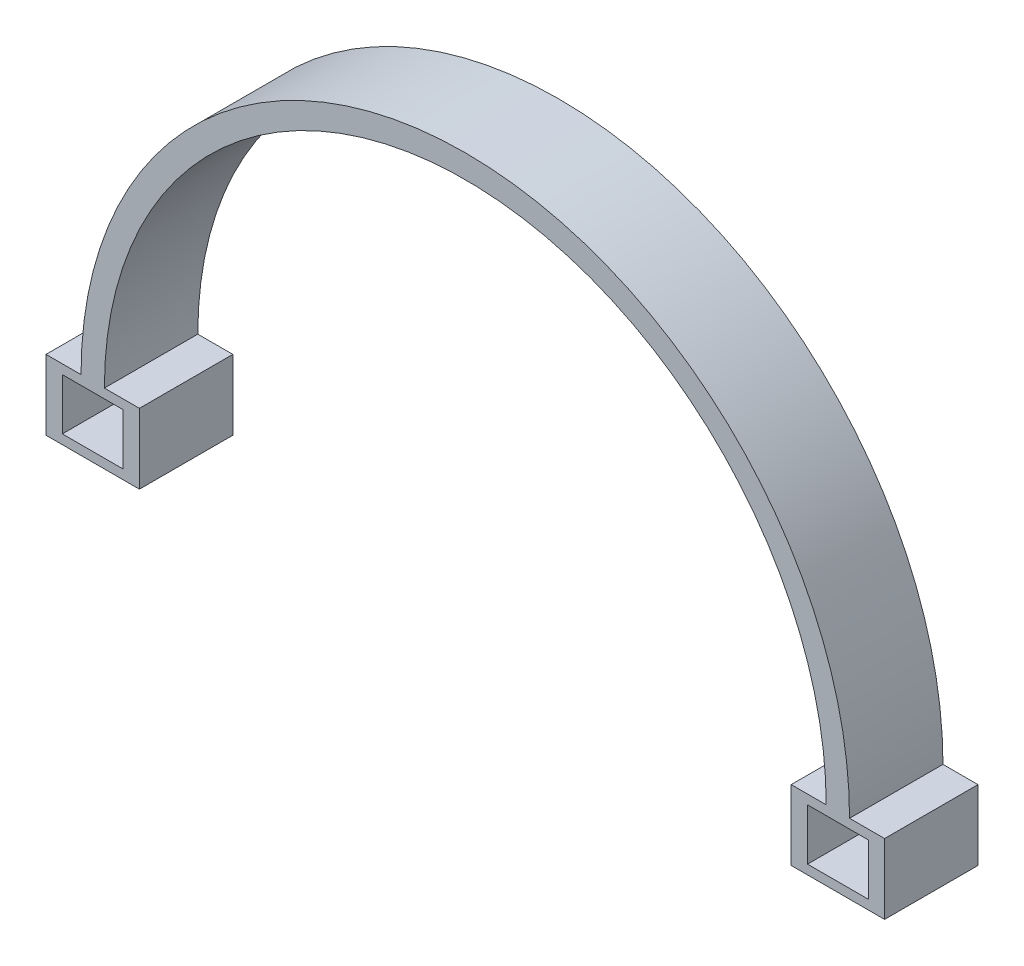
ISO-10303-21;
HEADER;
FILE_DESCRIPTION(('STEP AP214'),'2;1');
FILE_NAME('part.step','',(''),(''),'','','');
FILE_SCHEMA(('AUTOMOTIVE_DESIGN { 1 0 10303 214 1 1 1 1 }'));
ENDSEC;
DATA;
#1=APPLICATION_CONTEXT('core data for automotive mechanical design processes');
#2=APPLICATION_PROTOCOL_DEFINITION('international standard','automotive_design',2000,#1);
#3=PRODUCT_CONTEXT('',#1,'mechanical');
#4=PRODUCT('Part','Part','',(#3));
#5=PRODUCT_RELATED_PRODUCT_CATEGORY('part','',(#4));
#6=PRODUCT_DEFINITION_FORMATION('','',#4);
#7=PRODUCT_DEFINITION_CONTEXT('part definition',#1,'design');
#8=PRODUCT_DEFINITION('design','',#6,#7);
#9=PRODUCT_DEFINITION_SHAPE('','',#8);
#10=(LENGTH_UNIT() NAMED_UNIT(*) SI_UNIT(.MILLI.,.METRE.));
#11=(NAMED_UNIT(*) PLANE_ANGLE_UNIT() SI_UNIT($,.RADIAN.));
#12=(NAMED_UNIT(*) SI_UNIT($,.STERADIAN.) SOLID_ANGLE_UNIT());
#13=UNCERTAINTY_MEASURE_WITH_UNIT(LENGTH_MEASURE(1.E-05),#10,'distance_accuracy_value','');
#14=(GEOMETRIC_REPRESENTATION_CONTEXT(3) GLOBAL_UNCERTAINTY_ASSIGNED_CONTEXT((#13)) GLOBAL_UNIT_ASSIGNED_CONTEXT((#10,
#11,#12)) REPRESENTATION_CONTEXT('',''));
#15=CARTESIAN_POINT('',(0.,0.,0.));
#16=DIRECTION('',(0.,0.,1.));
#17=DIRECTION('',(1.,0.,0.));
#18=AXIS2_PLACEMENT_3D('',#15,#16,#17);
#19=CARTESIAN_POINT('',(0.,0.,20.));
#20=DIRECTION('',(0.,0.,-1.));
#21=DIRECTION('',(-1.,0.,0.));
#22=AXIS2_PLACEMENT_3D('',#19,#20,#21);
#23=CYLINDRICAL_SURFACE('',#22,77.2727272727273);
#24=CARTESIAN_POINT('',(0.,0.,0.));
#25=DIRECTION('',(0.,0.,-1.));
#26=DIRECTION('',(1.,0.,0.));
#27=AXIS2_PLACEMENT_3D('',#24,#25,#26);
#28=CIRCLE('',#27,77.2727272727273);
#29=CARTESIAN_POINT('',(-77.2727272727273,0.,0.));
#30=VERTEX_POINT('',#29);
#31=CARTESIAN_POINT('',(77.2727272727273,0.,0.));
#32=VERTEX_POINT('',#31);
#33=EDGE_CURVE('E63',#30,#32,#28,.T.);
#34=ORIENTED_EDGE('',*,*,#33,.T.);
#35=DIRECTION('',(0.,0.,-1.));
#36=VECTOR('',#35,1.);
#37=CARTESIAN_POINT('',(77.2727272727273,0.,20.));
#38=LINE('',#37,#36);
#39=CARTESIAN_POINT('',(77.2727272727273,0.,20.));
#40=VERTEX_POINT('',#39);
#41=EDGE_CURVE('E11',#40,#32,#38,.T.);
#42=ORIENTED_EDGE('',*,*,#41,.F.);
#43=CARTESIAN_POINT('',(0.,0.,20.));
#44=DIRECTION('',(0.,0.,-1.));
#45=DIRECTION('',(1.,0.,0.));
#46=AXIS2_PLACEMENT_3D('',#43,#44,#45);
#47=CIRCLE('',#46,77.2727272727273);
#48=CARTESIAN_POINT('',(-77.2727272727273,0.,20.));
#49=VERTEX_POINT('',#48);
#50=EDGE_CURVE('E53',#49,#40,#47,.T.);
#51=ORIENTED_EDGE('',*,*,#50,.F.);
#52=DIRECTION('',(0.,0.,-1.));
#53=VECTOR('',#52,1.);
#54=CARTESIAN_POINT('',(-77.2727272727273,0.,20.));
#55=LINE('',#54,#53);
#56=EDGE_CURVE('E91',#49,#30,#55,.T.);
#57=ORIENTED_EDGE('',*,*,#56,.T.);
#58=EDGE_LOOP('',(#34,#42,#51,#57));
#59=FACE_BOUND('',#58,.T.);
#60=ADVANCED_FACE('F37',(#59),#23,.F.);
#61=CARTESIAN_POINT('',(0.,0.,20.));
#62=DIRECTION('',(0.,0.,-1.));
#63=DIRECTION('',(-1.,0.,0.));
#64=AXIS2_PLACEMENT_3D('',#61,#62,#63);
#65=CYLINDRICAL_SURFACE('',#64,82.2727272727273);
#66=CARTESIAN_POINT('',(0.,0.,0.));
#67=DIRECTION('',(0.,0.,1.));
#68=DIRECTION('',(1.,0.,0.));
#69=AXIS2_PLACEMENT_3D('',#66,#67,#68);
#70=CIRCLE('',#69,82.2727272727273);
#71=CARTESIAN_POINT('',(82.2727272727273,0.,0.));
#72=VERTEX_POINT('',#71);
#73=CARTESIAN_POINT('',(-82.2727272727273,0.,0.));
#74=VERTEX_POINT('',#73);
#75=EDGE_CURVE('E208',#72,#74,#70,.T.);
#76=ORIENTED_EDGE('',*,*,#75,.T.);
#77=DIRECTION('',(0.,0.,-1.));
#78=VECTOR('',#77,1.);
#79=CARTESIAN_POINT('',(-82.2727272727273,0.,20.));
#80=LINE('',#79,#78);
#81=CARTESIAN_POINT('',(-82.2727272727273,0.,20.));
#82=VERTEX_POINT('',#81);
#83=EDGE_CURVE('E86',#82,#74,#80,.T.);
#84=ORIENTED_EDGE('',*,*,#83,.F.);
#85=CARTESIAN_POINT('',(0.,0.,20.));
#86=DIRECTION('',(0.,0.,1.));
#87=DIRECTION('',(1.,0.,0.));
#88=AXIS2_PLACEMENT_3D('',#85,#86,#87);
#89=CIRCLE('',#88,82.2727272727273);
#90=CARTESIAN_POINT('',(82.2727272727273,0.,20.));
#91=VERTEX_POINT('',#90);
#92=EDGE_CURVE('E80',#91,#82,#89,.T.);
#93=ORIENTED_EDGE('',*,*,#92,.F.);
#94=DIRECTION('',(0.,0.,-1.));
#95=VECTOR('',#94,1.);
#96=CARTESIAN_POINT('',(82.2727272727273,0.,20.));
#97=LINE('',#96,#95);
#98=EDGE_CURVE('E45',#91,#72,#97,.T.);
#99=ORIENTED_EDGE('',*,*,#98,.T.);
#100=EDGE_LOOP('',(#76,#84,#93,#99));
#101=FACE_BOUND('',#100,.T.);
#102=ADVANCED_FACE('F82',(#101),#65,.T.);
#103=CARTESIAN_POINT('',(0.,0.,20.));
#104=DIRECTION('',(0.,0.,1.));
#105=DIRECTION('',(1.,0.,0.));
#106=AXIS2_PLACEMENT_3D('',#103,#104,#105);
#107=PLANE('',#106);
#108=ORIENTED_EDGE('',*,*,#50,.T.);
#109=DIRECTION('',(1.,0.,0.));
#110=VECTOR('',#109,1.);
#111=CARTESIAN_POINT('',(89.7727272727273,0.,20.));
#112=LINE('',#111,#110);
#113=CARTESIAN_POINT('',(69.7727272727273,0.,20.));
#114=VERTEX_POINT('',#113);
#115=EDGE_CURVE('E108',#114,#40,#112,.T.);
#116=ORIENTED_EDGE('',*,*,#115,.F.);
#117=DIRECTION('',(0.,1.,0.));
#118=VECTOR('',#117,1.);
#119=CARTESIAN_POINT('',(69.7727272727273,0.,20.));
#120=LINE('',#119,#118);
#121=CARTESIAN_POINT('',(69.7727272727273,-15.,20.));
#122=VERTEX_POINT('',#121);
#123=EDGE_CURVE('E111',#122,#114,#120,.T.);
#124=ORIENTED_EDGE('',*,*,#123,.F.);
#125=DIRECTION('',(-1.,0.,0.));
#126=VECTOR('',#125,1.);
#127=CARTESIAN_POINT('',(89.7727272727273,-15.,20.));
#128=LINE('',#127,#126);
#129=CARTESIAN_POINT('',(89.7727272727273,-15.,20.));
#130=VERTEX_POINT('',#129);
#131=EDGE_CURVE('E118',#130,#122,#128,.T.);
#132=ORIENTED_EDGE('',*,*,#131,.F.);
#133=DIRECTION('',(0.,-1.,0.));
#134=VECTOR('',#133,1.);
#135=CARTESIAN_POINT('',(89.7727272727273,0.,20.));
#136=LINE('',#135,#134);
#137=CARTESIAN_POINT('',(89.7727272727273,0.,20.));
#138=VERTEX_POINT('',#137);
#139=EDGE_CURVE('E107',#138,#130,#136,.T.);
#140=ORIENTED_EDGE('',*,*,#139,.F.);
#141=EDGE_CURVE('E98',#91,#138,#112,.T.);
#142=ORIENTED_EDGE('',*,*,#141,.F.);
#143=ORIENTED_EDGE('',*,*,#92,.T.);
#144=DIRECTION('',(-1.,0.,0.));
#145=VECTOR('',#144,1.);
#146=CARTESIAN_POINT('',(-89.7727272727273,0.,20.));
#147=LINE('',#146,#145);
#148=CARTESIAN_POINT('',(-89.7727272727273,0.,20.));
#149=VERTEX_POINT('',#148);
#150=EDGE_CURVE('E194',#82,#149,#147,.T.);
#151=ORIENTED_EDGE('',*,*,#150,.T.);
#152=DIRECTION('',(0.,-1.,0.));
#153=VECTOR('',#152,1.);
#154=CARTESIAN_POINT('',(-89.7727272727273,0.,20.));
#155=LINE('',#154,#153);
#156=CARTESIAN_POINT('',(-89.7727272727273,-15.,20.));
#157=VERTEX_POINT('',#156);
#158=EDGE_CURVE('E162',#149,#157,#155,.T.);
#159=ORIENTED_EDGE('',*,*,#158,.T.);
#160=DIRECTION('',(1.,0.,0.));
#161=VECTOR('',#160,1.);
#162=CARTESIAN_POINT('',(-89.7727272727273,-15.,20.));
#163=LINE('',#162,#161);
#164=CARTESIAN_POINT('',(-69.7727272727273,-15.,20.));
#165=VERTEX_POINT('',#164);
#166=EDGE_CURVE('E188',#157,#165,#163,.T.);
#167=ORIENTED_EDGE('',*,*,#166,.T.);
#168=DIRECTION('',(0.,1.,0.));
#169=VECTOR('',#168,1.);
#170=CARTESIAN_POINT('',(-69.7727272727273,0.,20.));
#171=LINE('',#170,#169);
#172=CARTESIAN_POINT('',(-69.7727272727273,0.,20.));
#173=VERTEX_POINT('',#172);
#174=EDGE_CURVE('E191',#165,#173,#171,.T.);
#175=ORIENTED_EDGE('',*,*,#174,.T.);
#176=EDGE_CURVE('E175',#173,#49,#147,.T.);
#177=ORIENTED_EDGE('',*,*,#176,.T.);
#178=EDGE_LOOP('',(#108,#116,#124,#132,#140,#142,#143,#151,#159,#167,#175,#177));
#179=FACE_BOUND('',#178,.T.);
#180=DIRECTION('',(0.,-1.,0.));
#181=VECTOR('',#180,1.);
#182=CARTESIAN_POINT('',(-86.2770352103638,-2.,20.));
#183=LINE('',#182,#181);
#184=CARTESIAN_POINT('',(-86.2770352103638,-2.,20.));
#185=VERTEX_POINT('',#184);
#186=CARTESIAN_POINT('',(-86.2770352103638,-13.,20.));
#187=VERTEX_POINT('',#186);
#188=EDGE_CURVE('E125',#185,#187,#183,.T.);
#189=ORIENTED_EDGE('',*,*,#188,.F.);
#190=DIRECTION('',(-1.,0.,0.));
#191=VECTOR('',#190,1.);
#192=CARTESIAN_POINT('',(-86.2770352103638,-2.,20.));
#193=LINE('',#192,#191);
#194=CARTESIAN_POINT('',(-73.2727272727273,-2.,20.));
#195=VERTEX_POINT('',#194);
#196=EDGE_CURVE('E139',#195,#185,#193,.T.);
#197=ORIENTED_EDGE('',*,*,#196,.F.);
#198=DIRECTION('',(0.,1.,0.));
#199=VECTOR('',#198,1.);
#200=CARTESIAN_POINT('',(-73.2727272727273,-2.,20.));
#201=LINE('',#200,#199);
#202=CARTESIAN_POINT('',(-73.2727272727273,-13.,20.));
#203=VERTEX_POINT('',#202);
#204=EDGE_CURVE('E154',#203,#195,#201,.T.);
#205=ORIENTED_EDGE('',*,*,#204,.F.);
#206=DIRECTION('',(1.,0.,0.));
#207=VECTOR('',#206,1.);
#208=CARTESIAN_POINT('',(-86.2770352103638,-13.,20.));
#209=LINE('',#208,#207);
#210=EDGE_CURVE('E151',#187,#203,#209,.T.);
#211=ORIENTED_EDGE('',*,*,#210,.F.);
#212=EDGE_LOOP('',(#189,#197,#205,#211));
#213=FACE_BOUND('',#212,.T.);
#214=DIRECTION('',(1.,0.,0.));
#215=VECTOR('',#214,1.);
#216=CARTESIAN_POINT('',(86.2770352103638,-2.,20.));
#217=LINE('',#216,#215);
#218=CARTESIAN_POINT('',(73.2727272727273,-2.,20.));
#219=VERTEX_POINT('',#218);
#220=CARTESIAN_POINT('',(86.2770352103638,-2.,20.));
#221=VERTEX_POINT('',#220);
#222=EDGE_CURVE('E357',#219,#221,#217,.T.);
#223=ORIENTED_EDGE('',*,*,#222,.T.);
#224=DIRECTION('',(0.,-1.,0.));
#225=VECTOR('',#224,1.);
#226=CARTESIAN_POINT('',(86.2770352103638,-2.,20.));
#227=LINE('',#226,#225);
#228=CARTESIAN_POINT('',(86.2770352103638,-13.,20.));
#229=VERTEX_POINT('',#228);
#230=EDGE_CURVE('E344',#221,#229,#227,.T.);
#231=ORIENTED_EDGE('',*,*,#230,.T.);
#232=DIRECTION('',(-1.,0.,0.));
#233=VECTOR('',#232,1.);
#234=CARTESIAN_POINT('',(86.2770352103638,-13.,20.));
#235=LINE('',#234,#233);
#236=CARTESIAN_POINT('',(73.2727272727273,-13.,20.));
#237=VERTEX_POINT('',#236);
#238=EDGE_CURVE('E348',#229,#237,#235,.T.);
#239=ORIENTED_EDGE('',*,*,#238,.T.);
#240=DIRECTION('',(0.,1.,0.));
#241=VECTOR('',#240,1.);
#242=CARTESIAN_POINT('',(73.2727272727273,-2.,20.));
#243=LINE('',#242,#241);
#244=EDGE_CURVE('E351',#237,#219,#243,.T.);
#245=ORIENTED_EDGE('',*,*,#244,.T.);
#246=EDGE_LOOP('',(#223,#231,#239,#245));
#247=FACE_BOUND('',#246,.T.);
#248=ADVANCED_FACE('F103',(#179,#213,#247),#107,.T.);
#249=CARTESIAN_POINT('',(0.,0.,0.));
#250=DIRECTION('',(0.,0.,1.));
#251=DIRECTION('',(1.,0.,0.));
#252=AXIS2_PLACEMENT_3D('',#249,#250,#251);
#253=PLANE('',#252);
#254=ORIENTED_EDGE('',*,*,#33,.F.);
#255=DIRECTION('',(-1.,0.,0.));
#256=VECTOR('',#255,1.);
#257=CARTESIAN_POINT('',(-89.7727272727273,0.,0.));
#258=LINE('',#257,#256);
#259=CARTESIAN_POINT('',(-69.7727272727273,0.,0.));
#260=VERTEX_POINT('',#259);
#261=EDGE_CURVE('E182',#260,#30,#258,.T.);
#262=ORIENTED_EDGE('',*,*,#261,.F.);
#263=DIRECTION('',(0.,1.,0.));
#264=VECTOR('',#263,1.);
#265=CARTESIAN_POINT('',(-69.7727272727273,0.,0.));
#266=LINE('',#265,#264);
#267=CARTESIAN_POINT('',(-69.7727272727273,-15.,0.));
#268=VERTEX_POINT('',#267);
#269=EDGE_CURVE('E178',#268,#260,#266,.T.);
#270=ORIENTED_EDGE('',*,*,#269,.F.);
#271=DIRECTION('',(1.,0.,0.));
#272=VECTOR('',#271,1.);
#273=CARTESIAN_POINT('',(-89.7727272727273,-15.,0.));
#274=LINE('',#273,#272);
#275=CARTESIAN_POINT('',(-89.7727272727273,-15.,0.));
#276=VERTEX_POINT('',#275);
#277=EDGE_CURVE('E174',#276,#268,#274,.T.);
#278=ORIENTED_EDGE('',*,*,#277,.F.);
#279=DIRECTION('',(0.,-1.,0.));
#280=VECTOR('',#279,1.);
#281=CARTESIAN_POINT('',(-89.7727272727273,0.,0.));
#282=LINE('',#281,#280);
#283=CARTESIAN_POINT('',(-89.7727272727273,0.,0.));
#284=VERTEX_POINT('',#283);
#285=EDGE_CURVE('E171',#284,#276,#282,.T.);
#286=ORIENTED_EDGE('',*,*,#285,.F.);
#287=EDGE_CURVE('E181',#74,#284,#258,.T.);
#288=ORIENTED_EDGE('',*,*,#287,.F.);
#289=ORIENTED_EDGE('',*,*,#75,.F.);
#290=DIRECTION('',(1.,0.,0.));
#291=VECTOR('',#290,1.);
#292=CARTESIAN_POINT('',(89.7727272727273,0.,0.));
#293=LINE('',#292,#291);
#294=CARTESIAN_POINT('',(89.7727272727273,0.,0.));
#295=VERTEX_POINT('',#294);
#296=EDGE_CURVE('E101',#72,#295,#293,.T.);
#297=ORIENTED_EDGE('',*,*,#296,.T.);
#298=DIRECTION('',(0.,-1.,0.));
#299=VECTOR('',#298,1.);
#300=CARTESIAN_POINT('',(89.7727272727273,0.,0.));
#301=LINE('',#300,#299);
#302=CARTESIAN_POINT('',(89.7727272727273,-15.,0.));
#303=VERTEX_POINT('',#302);
#304=EDGE_CURVE('E121',#295,#303,#301,.T.);
#305=ORIENTED_EDGE('',*,*,#304,.T.);
#306=DIRECTION('',(-1.,0.,0.));
#307=VECTOR('',#306,1.);
#308=CARTESIAN_POINT('',(89.7727272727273,-15.,0.));
#309=LINE('',#308,#307);
#310=CARTESIAN_POINT('',(69.7727272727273,-15.,0.));
#311=VERTEX_POINT('',#310);
#312=EDGE_CURVE('E134',#303,#311,#309,.T.);
#313=ORIENTED_EDGE('',*,*,#312,.T.);
#314=DIRECTION('',(0.,1.,0.));
#315=VECTOR('',#314,1.);
#316=CARTESIAN_POINT('',(69.7727272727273,0.,0.));
#317=LINE('',#316,#315);
#318=CARTESIAN_POINT('',(69.7727272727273,0.,0.));
#319=VERTEX_POINT('',#318);
#320=EDGE_CURVE('E369',#311,#319,#317,.T.);
#321=ORIENTED_EDGE('',*,*,#320,.T.);
#322=EDGE_CURVE('E367',#319,#32,#293,.T.);
#323=ORIENTED_EDGE('',*,*,#322,.T.);
#324=EDGE_LOOP('',(#254,#262,#270,#278,#286,#288,#289,#297,#305,#313,#321,#323));
#325=FACE_BOUND('',#324,.T.);
#326=DIRECTION('',(-1.,0.,0.));
#327=VECTOR('',#326,1.);
#328=CARTESIAN_POINT('',(-86.2770352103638,-2.,0.));
#329=LINE('',#328,#327);
#330=CARTESIAN_POINT('',(-73.2727272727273,-2.,0.));
#331=VERTEX_POINT('',#330);
#332=CARTESIAN_POINT('',(-86.2770352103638,-2.,0.));
#333=VERTEX_POINT('',#332);
#334=EDGE_CURVE('E145',#331,#333,#329,.T.);
#335=ORIENTED_EDGE('',*,*,#334,.T.);
#336=DIRECTION('',(0.,-1.,0.));
#337=VECTOR('',#336,1.);
#338=CARTESIAN_POINT('',(-86.2770352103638,-2.,0.));
#339=LINE('',#338,#337);
#340=CARTESIAN_POINT('',(-86.2770352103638,-13.,0.));
#341=VERTEX_POINT('',#340);
#342=EDGE_CURVE('E135',#333,#341,#339,.T.);
#343=ORIENTED_EDGE('',*,*,#342,.T.);
#344=DIRECTION('',(1.,0.,0.));
#345=VECTOR('',#344,1.);
#346=CARTESIAN_POINT('',(-86.2770352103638,-13.,0.));
#347=LINE('',#346,#345);
#348=CARTESIAN_POINT('',(-73.2727272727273,-13.,0.));
#349=VERTEX_POINT('',#348);
#350=EDGE_CURVE('E138',#341,#349,#347,.T.);
#351=ORIENTED_EDGE('',*,*,#350,.T.);
#352=DIRECTION('',(0.,1.,0.));
#353=VECTOR('',#352,1.);
#354=CARTESIAN_POINT('',(-73.2727272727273,-2.,0.));
#355=LINE('',#354,#353);
#356=EDGE_CURVE('E142',#349,#331,#355,.T.);
#357=ORIENTED_EDGE('',*,*,#356,.T.);
#358=EDGE_LOOP('',(#335,#343,#351,#357));
#359=FACE_BOUND('',#358,.T.);
#360=DIRECTION('',(0.,-1.,0.));
#361=VECTOR('',#360,1.);
#362=CARTESIAN_POINT('',(86.2770352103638,-2.,0.));
#363=LINE('',#362,#361);
#364=CARTESIAN_POINT('',(86.2770352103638,-2.,0.));
#365=VERTEX_POINT('',#364);
#366=CARTESIAN_POINT('',(86.2770352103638,-13.,0.));
#367=VERTEX_POINT('',#366);
#368=EDGE_CURVE('E337',#365,#367,#363,.T.);
#369=ORIENTED_EDGE('',*,*,#368,.F.);
#370=DIRECTION('',(1.,0.,0.));
#371=VECTOR('',#370,1.);
#372=CARTESIAN_POINT('',(86.2770352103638,-2.,0.));
#373=LINE('',#372,#371);
#374=CARTESIAN_POINT('',(73.2727272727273,-2.,0.));
#375=VERTEX_POINT('',#374);
#376=EDGE_CURVE('E325',#375,#365,#373,.T.);
#377=ORIENTED_EDGE('',*,*,#376,.F.);
#378=DIRECTION('',(0.,1.,0.));
#379=VECTOR('',#378,1.);
#380=CARTESIAN_POINT('',(73.2727272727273,-2.,0.));
#381=LINE('',#380,#379);
#382=CARTESIAN_POINT('',(73.2727272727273,-13.,0.));
#383=VERTEX_POINT('',#382);
#384=EDGE_CURVE('E336',#383,#375,#381,.T.);
#385=ORIENTED_EDGE('',*,*,#384,.F.);
#386=DIRECTION('',(-1.,0.,0.));
#387=VECTOR('',#386,1.);
#388=CARTESIAN_POINT('',(86.2770352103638,-13.,0.));
#389=LINE('',#388,#387);
#390=EDGE_CURVE('E345',#367,#383,#389,.T.);
#391=ORIENTED_EDGE('',*,*,#390,.F.);
#392=EDGE_LOOP('',(#369,#377,#385,#391));
#393=FACE_BOUND('',#392,.T.);
#394=ADVANCED_FACE('F221',(#325,#359,#393),#253,.F.);
#395=CARTESIAN_POINT('',(-89.7727272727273,0.,0.));
#396=DIRECTION('',(0.,1.,0.));
#397=DIRECTION('',(0.,0.,1.));
#398=AXIS2_PLACEMENT_3D('',#395,#396,#397);
#399=PLANE('',#398);
#400=ORIENTED_EDGE('',*,*,#56,.F.);
#401=ORIENTED_EDGE('',*,*,#176,.F.);
#402=DIRECTION('',(0.,0.,1.));
#403=VECTOR('',#402,1.);
#404=CARTESIAN_POINT('',(-69.7727272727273,0.,0.));
#405=LINE('',#404,#403);
#406=EDGE_CURVE('E200',#260,#173,#405,.T.);
#407=ORIENTED_EDGE('',*,*,#406,.F.);
#408=ORIENTED_EDGE('',*,*,#261,.T.);
#409=EDGE_LOOP('',(#400,#401,#407,#408));
#410=FACE_BOUND('',#409,.T.);
#411=ADVANCED_FACE('F394',(#410),#399,.T.);
#412=ORIENTED_EDGE('',*,*,#83,.T.);
#413=ORIENTED_EDGE('',*,*,#287,.T.);
#414=DIRECTION('',(0.,0.,1.));
#415=VECTOR('',#414,1.);
#416=CARTESIAN_POINT('',(-89.7727272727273,0.,0.));
#417=LINE('',#416,#415);
#418=EDGE_CURVE('E197',#284,#149,#417,.T.);
#419=ORIENTED_EDGE('',*,*,#418,.T.);
#420=ORIENTED_EDGE('',*,*,#150,.F.);
#421=EDGE_LOOP('',(#412,#413,#419,#420));
#422=FACE_BOUND('',#421,.T.);
#423=ADVANCED_FACE('F216',(#422),#399,.T.);
#424=CARTESIAN_POINT('',(-89.7727272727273,0.,0.));
#425=DIRECTION('',(-1.,0.,0.));
#426=DIRECTION('',(0.,0.,1.));
#427=AXIS2_PLACEMENT_3D('',#424,#425,#426);
#428=PLANE('',#427);
#429=ORIENTED_EDGE('',*,*,#158,.F.);
#430=ORIENTED_EDGE('',*,*,#418,.F.);
#431=ORIENTED_EDGE('',*,*,#285,.T.);
#432=DIRECTION('',(0.,0.,1.));
#433=VECTOR('',#432,1.);
#434=CARTESIAN_POINT('',(-89.7727272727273,-15.,0.));
#435=LINE('',#434,#433);
#436=EDGE_CURVE('E185',#276,#157,#435,.T.);
#437=ORIENTED_EDGE('',*,*,#436,.T.);
#438=EDGE_LOOP('',(#429,#430,#431,#437));
#439=FACE_BOUND('',#438,.T.);
#440=ADVANCED_FACE('F230',(#439),#428,.T.);
#441=CARTESIAN_POINT('',(-69.7727272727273,0.,0.));
#442=DIRECTION('',(1.,0.,0.));
#443=DIRECTION('',(0.,0.,-1.));
#444=AXIS2_PLACEMENT_3D('',#441,#442,#443);
#445=PLANE('',#444);
#446=ORIENTED_EDGE('',*,*,#174,.F.);
#447=DIRECTION('',(0.,0.,1.));
#448=VECTOR('',#447,1.);
#449=CARTESIAN_POINT('',(-69.7727272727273,-15.,0.));
#450=LINE('',#449,#448);
#451=EDGE_CURVE('E203',#268,#165,#450,.T.);
#452=ORIENTED_EDGE('',*,*,#451,.F.);
#453=ORIENTED_EDGE('',*,*,#269,.T.);
#454=ORIENTED_EDGE('',*,*,#406,.T.);
#455=EDGE_LOOP('',(#446,#452,#453,#454));
#456=FACE_BOUND('',#455,.T.);
#457=ADVANCED_FACE('F398',(#456),#445,.T.);
#458=CARTESIAN_POINT('',(-89.7727272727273,-15.,0.));
#459=DIRECTION('',(0.,-1.,0.));
#460=DIRECTION('',(0.,0.,-1.));
#461=AXIS2_PLACEMENT_3D('',#458,#459,#460);
#462=PLANE('',#461);
#463=ORIENTED_EDGE('',*,*,#166,.F.);
#464=ORIENTED_EDGE('',*,*,#436,.F.);
#465=ORIENTED_EDGE('',*,*,#277,.T.);
#466=ORIENTED_EDGE('',*,*,#451,.T.);
#467=EDGE_LOOP('',(#463,#464,#465,#466));
#468=FACE_BOUND('',#467,.T.);
#469=ADVANCED_FACE('F399',(#468),#462,.T.);
#470=CARTESIAN_POINT('',(-86.2770352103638,-2.,0.));
#471=DIRECTION('',(-1.,0.,0.));
#472=DIRECTION('',(0.,0.,1.));
#473=AXIS2_PLACEMENT_3D('',#470,#471,#472);
#474=PLANE('',#473);
#475=ORIENTED_EDGE('',*,*,#188,.T.);
#476=DIRECTION('',(0.,0.,1.));
#477=VECTOR('',#476,1.);
#478=CARTESIAN_POINT('',(-86.2770352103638,-13.,0.));
#479=LINE('',#478,#477);
#480=EDGE_CURVE('E148',#341,#187,#479,.T.);
#481=ORIENTED_EDGE('',*,*,#480,.F.);
#482=ORIENTED_EDGE('',*,*,#342,.F.);
#483=DIRECTION('',(0.,0.,1.));
#484=VECTOR('',#483,1.);
#485=CARTESIAN_POINT('',(-86.2770352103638,-2.,0.));
#486=LINE('',#485,#484);
#487=EDGE_CURVE('E159',#333,#185,#486,.T.);
#488=ORIENTED_EDGE('',*,*,#487,.T.);
#489=EDGE_LOOP('',(#475,#481,#482,#488));
#490=FACE_BOUND('',#489,.T.);
#491=ADVANCED_FACE('F255',(#490),#474,.F.);
#492=CARTESIAN_POINT('',(-86.2770352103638,-2.,0.));
#493=DIRECTION('',(0.,1.,0.));
#494=DIRECTION('',(0.,0.,1.));
#495=AXIS2_PLACEMENT_3D('',#492,#493,#494);
#496=PLANE('',#495);
#497=ORIENTED_EDGE('',*,*,#196,.T.);
#498=ORIENTED_EDGE('',*,*,#487,.F.);
#499=ORIENTED_EDGE('',*,*,#334,.F.);
#500=DIRECTION('',(0.,0.,1.));
#501=VECTOR('',#500,1.);
#502=CARTESIAN_POINT('',(-73.2727272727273,-2.,0.));
#503=LINE('',#502,#501);
#504=EDGE_CURVE('E163',#331,#195,#503,.T.);
#505=ORIENTED_EDGE('',*,*,#504,.T.);
#506=EDGE_LOOP('',(#497,#498,#499,#505));
#507=FACE_BOUND('',#506,.T.);
#508=ADVANCED_FACE('F410',(#507),#496,.F.);
#509=CARTESIAN_POINT('',(-73.2727272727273,-2.,0.));
#510=DIRECTION('',(1.,0.,0.));
#511=DIRECTION('',(0.,0.,-1.));
#512=AXIS2_PLACEMENT_3D('',#509,#510,#511);
#513=PLANE('',#512);
#514=ORIENTED_EDGE('',*,*,#204,.T.);
#515=ORIENTED_EDGE('',*,*,#504,.F.);
#516=ORIENTED_EDGE('',*,*,#356,.F.);
#517=DIRECTION('',(0.,0.,1.));
#518=VECTOR('',#517,1.);
#519=CARTESIAN_POINT('',(-73.2727272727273,-13.,0.));
#520=LINE('',#519,#518);
#521=EDGE_CURVE('E166',#349,#203,#520,.T.);
#522=ORIENTED_EDGE('',*,*,#521,.T.);
#523=EDGE_LOOP('',(#514,#515,#516,#522));
#524=FACE_BOUND('',#523,.T.);
#525=ADVANCED_FACE('F272',(#524),#513,.F.);
#526=CARTESIAN_POINT('',(-86.2770352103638,-13.,0.));
#527=DIRECTION('',(0.,-1.,0.));
#528=DIRECTION('',(0.,0.,-1.));
#529=AXIS2_PLACEMENT_3D('',#526,#527,#528);
#530=PLANE('',#529);
#531=ORIENTED_EDGE('',*,*,#210,.T.);
#532=ORIENTED_EDGE('',*,*,#521,.F.);
#533=ORIENTED_EDGE('',*,*,#350,.F.);
#534=ORIENTED_EDGE('',*,*,#480,.T.);
#535=EDGE_LOOP('',(#531,#532,#533,#534));
#536=FACE_BOUND('',#535,.T.);
#537=ADVANCED_FACE('F263',(#536),#530,.F.);
#538=CARTESIAN_POINT('',(89.7727272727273,0.,0.));
#539=DIRECTION('',(0.,-1.,0.));
#540=DIRECTION('',(0.,0.,-1.));
#541=AXIS2_PLACEMENT_3D('',#538,#539,#540);
#542=PLANE('',#541);
#543=ORIENTED_EDGE('',*,*,#115,.T.);
#544=ORIENTED_EDGE('',*,*,#41,.T.);
#545=ORIENTED_EDGE('',*,*,#322,.F.);
#546=DIRECTION('',(0.,0.,1.));
#547=VECTOR('',#546,1.);
#548=CARTESIAN_POINT('',(69.7727272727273,0.,0.));
#549=LINE('',#548,#547);
#550=EDGE_CURVE('E129',#319,#114,#549,.T.);
#551=ORIENTED_EDGE('',*,*,#550,.T.);
#552=EDGE_LOOP('',(#543,#544,#545,#551));
#553=FACE_BOUND('',#552,.T.);
#554=ADVANCED_FACE('F383',(#553),#542,.F.);
#555=ORIENTED_EDGE('',*,*,#296,.F.);
#556=ORIENTED_EDGE('',*,*,#98,.F.);
#557=ORIENTED_EDGE('',*,*,#141,.T.);
#558=DIRECTION('',(0.,0.,1.));
#559=VECTOR('',#558,1.);
#560=CARTESIAN_POINT('',(89.7727272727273,0.,0.));
#561=LINE('',#560,#559);
#562=EDGE_CURVE('E132',#295,#138,#561,.T.);
#563=ORIENTED_EDGE('',*,*,#562,.F.);
#564=EDGE_LOOP('',(#555,#556,#557,#563));
#565=FACE_BOUND('',#564,.T.);
#566=ADVANCED_FACE('F95',(#565),#542,.F.);
#567=CARTESIAN_POINT('',(89.7727272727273,0.,0.));
#568=DIRECTION('',(-1.,0.,0.));
#569=DIRECTION('',(0.,0.,1.));
#570=AXIS2_PLACEMENT_3D('',#567,#568,#569);
#571=PLANE('',#570);
#572=ORIENTED_EDGE('',*,*,#139,.T.);
#573=DIRECTION('',(0.,0.,1.));
#574=VECTOR('',#573,1.);
#575=CARTESIAN_POINT('',(89.7727272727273,-15.,0.));
#576=LINE('',#575,#574);
#577=EDGE_CURVE('E122',#303,#130,#576,.T.);
#578=ORIENTED_EDGE('',*,*,#577,.F.);
#579=ORIENTED_EDGE('',*,*,#304,.F.);
#580=ORIENTED_EDGE('',*,*,#562,.T.);
#581=EDGE_LOOP('',(#572,#578,#579,#580));
#582=FACE_BOUND('',#581,.T.);
#583=ADVANCED_FACE('F417',(#582),#571,.F.);
#584=CARTESIAN_POINT('',(89.7727272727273,-15.,0.));
#585=DIRECTION('',(0.,1.,0.));
#586=DIRECTION('',(0.,0.,1.));
#587=AXIS2_PLACEMENT_3D('',#584,#585,#586);
#588=PLANE('',#587);
#589=ORIENTED_EDGE('',*,*,#131,.T.);
#590=DIRECTION('',(0.,0.,1.));
#591=VECTOR('',#590,1.);
#592=CARTESIAN_POINT('',(69.7727272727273,-15.,0.));
#593=LINE('',#592,#591);
#594=EDGE_CURVE('E126',#311,#122,#593,.T.);
#595=ORIENTED_EDGE('',*,*,#594,.F.);
#596=ORIENTED_EDGE('',*,*,#312,.F.);
#597=ORIENTED_EDGE('',*,*,#577,.T.);
#598=EDGE_LOOP('',(#589,#595,#596,#597));
#599=FACE_BOUND('',#598,.T.);
#600=ADVANCED_FACE('F376',(#599),#588,.F.);
#601=CARTESIAN_POINT('',(69.7727272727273,0.,0.));
#602=DIRECTION('',(1.,0.,0.));
#603=DIRECTION('',(0.,0.,-1.));
#604=AXIS2_PLACEMENT_3D('',#601,#602,#603);
#605=PLANE('',#604);
#606=ORIENTED_EDGE('',*,*,#123,.T.);
#607=ORIENTED_EDGE('',*,*,#550,.F.);
#608=ORIENTED_EDGE('',*,*,#320,.F.);
#609=ORIENTED_EDGE('',*,*,#594,.T.);
#610=EDGE_LOOP('',(#606,#607,#608,#609));
#611=FACE_BOUND('',#610,.T.);
#612=ADVANCED_FACE('F379',(#611),#605,.F.);
#613=CARTESIAN_POINT('',(86.2770352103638,-2.,0.));
#614=DIRECTION('',(-1.,0.,0.));
#615=DIRECTION('',(0.,0.,1.));
#616=AXIS2_PLACEMENT_3D('',#613,#614,#615);
#617=PLANE('',#616);
#618=ORIENTED_EDGE('',*,*,#230,.F.);
#619=DIRECTION('',(0.,0.,1.));
#620=VECTOR('',#619,1.);
#621=CARTESIAN_POINT('',(86.2770352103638,-2.,0.));
#622=LINE('',#621,#620);
#623=EDGE_CURVE('E329',#365,#221,#622,.T.);
#624=ORIENTED_EDGE('',*,*,#623,.F.);
#625=ORIENTED_EDGE('',*,*,#368,.T.);
#626=DIRECTION('',(0.,0.,1.));
#627=VECTOR('',#626,1.);
#628=CARTESIAN_POINT('',(86.2770352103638,-13.,0.));
#629=LINE('',#628,#627);
#630=EDGE_CURVE('E112',#367,#229,#629,.T.);
#631=ORIENTED_EDGE('',*,*,#630,.T.);
#632=EDGE_LOOP('',(#618,#624,#625,#631));
#633=FACE_BOUND('',#632,.T.);
#634=ADVANCED_FACE('F340',(#633),#617,.T.);
#635=CARTESIAN_POINT('',(86.2770352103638,-13.,0.));
#636=DIRECTION('',(0.,1.,0.));
#637=DIRECTION('',(0.,0.,1.));
#638=AXIS2_PLACEMENT_3D('',#635,#636,#637);
#639=PLANE('',#638);
#640=ORIENTED_EDGE('',*,*,#238,.F.);
#641=ORIENTED_EDGE('',*,*,#630,.F.);
#642=ORIENTED_EDGE('',*,*,#390,.T.);
#643=DIRECTION('',(0.,0.,1.));
#644=VECTOR('',#643,1.);
#645=CARTESIAN_POINT('',(73.2727272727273,-13.,0.));
#646=LINE('',#645,#644);
#647=EDGE_CURVE('E362',#383,#237,#646,.T.);
#648=ORIENTED_EDGE('',*,*,#647,.T.);
#649=EDGE_LOOP('',(#640,#641,#642,#648));
#650=FACE_BOUND('',#649,.T.);
#651=ADVANCED_FACE('F429',(#650),#639,.T.);
#652=CARTESIAN_POINT('',(73.2727272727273,-2.,0.));
#653=DIRECTION('',(1.,0.,0.));
#654=DIRECTION('',(0.,0.,-1.));
#655=AXIS2_PLACEMENT_3D('',#652,#653,#654);
#656=PLANE('',#655);
#657=ORIENTED_EDGE('',*,*,#244,.F.);
#658=ORIENTED_EDGE('',*,*,#647,.F.);
#659=ORIENTED_EDGE('',*,*,#384,.T.);
#660=DIRECTION('',(0.,0.,1.));
#661=VECTOR('',#660,1.);
#662=CARTESIAN_POINT('',(73.2727272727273,-2.,0.));
#663=LINE('',#662,#661);
#664=EDGE_CURVE('E331',#375,#219,#663,.T.);
#665=ORIENTED_EDGE('',*,*,#664,.T.);
#666=EDGE_LOOP('',(#657,#658,#659,#665));
#667=FACE_BOUND('',#666,.T.);
#668=ADVANCED_FACE('F432',(#667),#656,.T.);
#669=CARTESIAN_POINT('',(86.2770352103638,-2.,0.));
#670=DIRECTION('',(0.,-1.,0.));
#671=DIRECTION('',(0.,0.,-1.));
#672=AXIS2_PLACEMENT_3D('',#669,#670,#671);
#673=PLANE('',#672);
#674=ORIENTED_EDGE('',*,*,#222,.F.);
#675=ORIENTED_EDGE('',*,*,#664,.F.);
#676=ORIENTED_EDGE('',*,*,#376,.T.);
#677=ORIENTED_EDGE('',*,*,#623,.T.);
#678=EDGE_LOOP('',(#674,#675,#676,#677));
#679=FACE_BOUND('',#678,.T.);
#680=ADVANCED_FACE('F328',(#679),#673,.T.);
#681=CLOSED_SHELL('',(#60,#102,#248,#394,#411,#423,#440,#457,#469,#491,#508,#525,#537,#554,#566,
#583,#600,#612,#634,#651,#668,#680));
#682=MANIFOLD_SOLID_BREP('B2',#681);
#683=ADVANCED_BREP_SHAPE_REPRESENTATION('',(#18,#682),#14);
#684=SHAPE_DEFINITION_REPRESENTATION(#9,#683);
ENDSEC;
END-ISO-10303-21;
